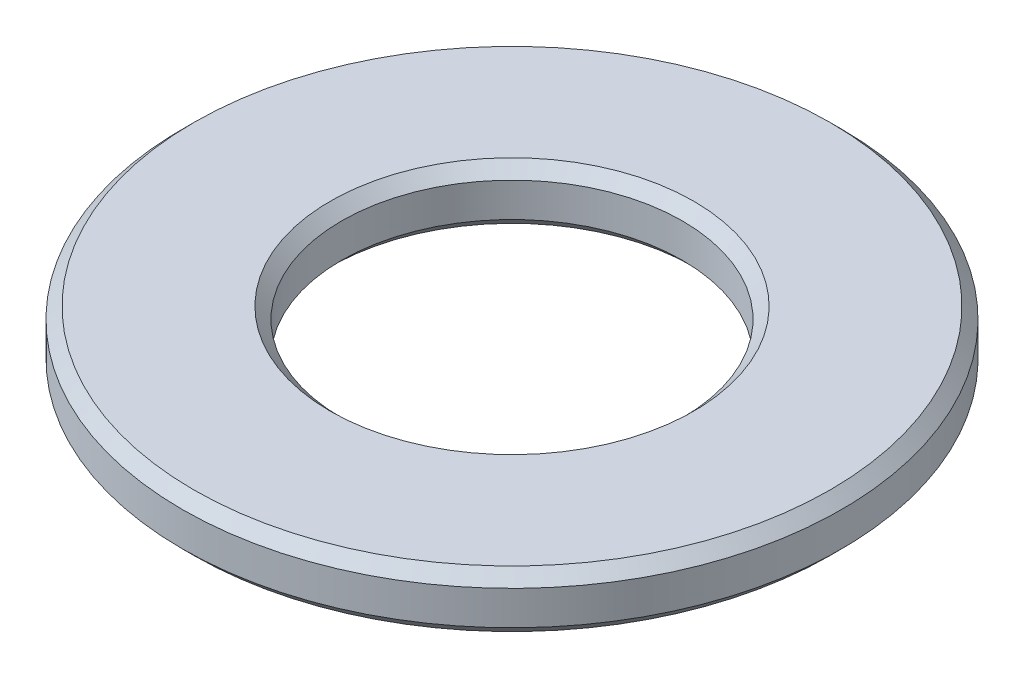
from build123d import *

# Parameters (mm, degrees)
SKIZZE1_R                       = 2.9
SKIZZE1_R_2                     = 1.5
AUFSATZ_LINEAR_AUSTRAGEN1_DEPTH = 0.5
FASE1_SIZE                      = 0.1


with BuildPart() as part:
    # Skizze1 → Aufsatz-Linear austragen1 (new body)
    with BuildSketch(Plane(origin=(0, 0, 0), x_dir=(1, 0, 0), z_dir=(0, 1, 0))):
        with Locations(Location((0, 0, 0), (0, 0, 270))):
            Circle(SKIZZE1_R)
        with Locations(Location((0, 0, 0), (0, 0, 270))):
            Circle(SKIZZE1_R_2, mode=Mode.SUBTRACT)
    extrude(amount=AUFSATZ_LINEAR_AUSTRAGEN1_DEPTH)

    # Fase1
    fase1_edges = [part.edges().sort_by_distance(p)[0] for p in [
        (0, 0, -2.9),
        (0, 0.5, -2.9),
        (0, 0, -1.5),
        (0, 0.5, -1.5),
    ]]
    chamfer(fase1_edges, length=FASE1_SIZE)


solid = part.part
